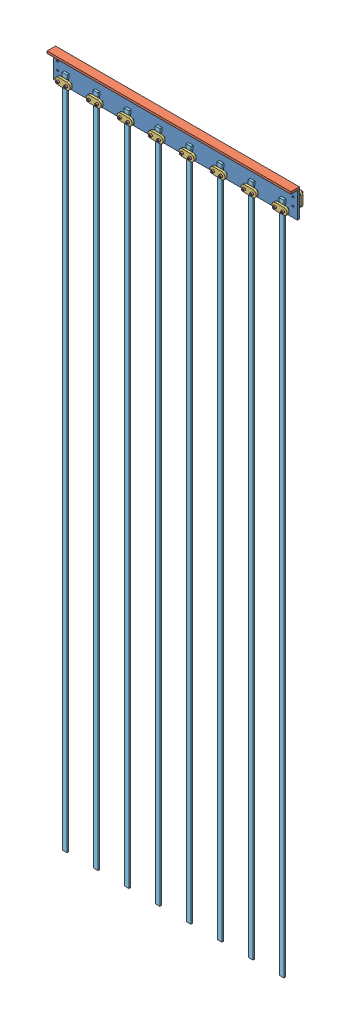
SolidWorks assembly fs-ua-left-mount-assembly-with-led-strips.SLDASM, configuration Default (file format 9000). Lengths in mm.
Overall size (723.9 2044.33 45.12).
42 component instances, 5 part files, 0 mates.
Components (placement in the parent):
- fs-ua-left-mount-assembly-with-screws-1: fs-ua-left-mount-assembly-with-screws.SLDASM [Default] at origin size (723.9 82.55 45.12)
  - fs-ua-left-mount-assembly-1: fs-ua-left-mount-assembly.SLDASM [Default] at origin size (723.9 82.55 38.15)
    - fs-ua-left-mount-vertical-component-1: fs-ua-left-mount-vertical-component.SLDPRT [Default] at origin size (723.9 76.2 6.35)
    - fs-ua-left-mount-horizontal-component-1: fs-ua-left-mount-horizontal-component.SLDPRT [Default] at (361.95 76.2 12.7) size (723.9 6.35 25.4)
    - fs-clamp-1: fs-clamp.SLDPRT [Default] at (27.94 15.24 12.7326) size (44.45 20.32 6.35)
    - fs-clamp-2: fs-clamp.SLDPRT [Default] at (12.7 29.845 -12.7409) x (0 1 0) z (0 0 1) size (44.45 20.32 6.35)
    - fs-clamp-3: fs-clamp.SLDPRT [Default] at (711.2 29.845 -6.3972) x (0 1 0) z (0 0 -1) size (44.45 20.32 6.35)
    - fs-clamp-4: fs-clamp.SLDPRT [Default] at (119.9243 15.24 12.7326) size (44.45 20.32 6.35)
    - fs-clamp-5: fs-clamp.SLDPRT [Default] at (211.9086 15.24 12.7326) size (44.45 20.32 6.35)
    - fs-clamp-6: fs-clamp.SLDPRT [Default] at (303.893 15.24 12.7326) size (44.45 20.32 6.35)
    - fs-clamp-7: fs-clamp.SLDPRT [Default] at (395.8773 15.24 12.7326) size (44.45 20.32 6.35)
    - fs-clamp-8: fs-clamp.SLDPRT [Default] at (487.8616 15.24 12.7326) size (44.45 20.32 6.35)
    - fs-clamp-9: fs-clamp.SLDPRT [Default] at (579.8459 15.24 12.7326) size (44.45 20.32 6.35)
    - fs-clamp-10: fs-clamp.SLDPRT [Default] at (671.8303 15.24 12.7326) size (44.45 20.32 6.35)
  - socket head cap screw_ai-1: socket head cap screw_ai.sldprt [HX-SHCS 0.19-32x0.875x0.875-N] at (27.94 15.24 25.0524) x (0 0 -1) z (-0.570283 0.821448 0) size (27.05 7.94 7.94)
  - socket head cap screw_ai-2: socket head cap screw_ai.sldprt [HX-SHCS 0.19-32x0.875x0.875-N] at (711.2 53.975 -19.4006) x (0 0 1) z (-0.954871 -0.29702 0) size (27.05 7.94 7.94)
  - socket head cap screw_ai-3: socket head cap screw_ai.sldprt [HX-SHCS 0.19-32x0.875x0.875-N] at (711.2 29.845 -19.7235) x (0 0 1) z (-0.178736 -0.983897 0) size (27.05 7.94 7.94)
  - socket head cap screw_ai-4: socket head cap screw_ai.sldprt [HX-SHCS 0.19-32x0.875x0.875-N] at (12.7 53.975 -19.387) x (0 0 1) z (0.231262 0.972891 0) size (27.05 7.94 7.94)
  - socket head cap screw_ai-5: socket head cap screw_ai.sldprt [HX-SHCS 0.19-32x0.875x0.875-N] at (12.7 29.845 -19.6757) x (0 0 1) z (-0.841681 -0.539975 0) size (27.05 7.94 7.94)
  - socket head cap screw_ai-6: socket head cap screw_ai.sldprt [HX-SHCS 0.19-32x0.875x0.875-N] at (52.07 15.24 25.3347) x (0 0 -1) z (0.61191 -0.790927 0) size (27.05 7.94 7.94)
  - socket head cap screw_ai-7: socket head cap screw_ai.sldprt [HX-SHCS 0.19-32x0.875x0.875-N] at (119.9251 15.24 25.0524) x (0 0 -1) z (-0.570283 0.821448 0) size (27.05 7.94 7.94)
  - socket head cap screw_ai-8: socket head cap screw_ai.sldprt [HX-SHCS 0.19-32x0.875x0.875-N] at (211.9102 15.24 25.0524) x (0 0 -1) z (-0.570283 0.821448 0) size (27.05 7.94 7.94)
  - socket head cap screw_ai-9: socket head cap screw_ai.sldprt [HX-SHCS 0.19-32x0.875x0.875-N] at (303.8953 15.24 25.0524) x (0 0 -1) z (-0.570283 0.821448 0) size (27.05 7.94 7.94)
  - socket head cap screw_ai-10: socket head cap screw_ai.sldprt [HX-SHCS 0.19-32x0.875x0.875-N] at (395.8803 15.24 25.0524) x (0 0 -1) z (-0.570283 0.821448 0) size (27.05 7.94 7.94)
  - socket head cap screw_ai-11: socket head cap screw_ai.sldprt [HX-SHCS 0.19-32x0.875x0.875-N] at (487.8654 15.24 25.0524) x (0 0 -1) z (-0.570283 0.821448 0) size (27.05 7.94 7.94)
  - socket head cap screw_ai-12: socket head cap screw_ai.sldprt [HX-SHCS 0.19-32x0.875x0.875-N] at (579.8505 15.24 25.0524) x (0 0 -1) z (-0.570283 0.821448 0) size (27.05 7.94 7.94)
  - socket head cap screw_ai-13: socket head cap screw_ai.sldprt [HX-SHCS 0.19-32x0.875x0.875-N] at (671.8356 15.24 25.0524) x (0 0 -1) z (-0.570283 0.821448 0) size (27.05 7.94 7.94)
  - socket head cap screw_ai-14: socket head cap screw_ai.sldprt [HX-SHCS 0.19-32x0.875x0.875-N] at (144.0551 15.24 25.3347) x (0 0 -1) z (0.61191 -0.790927 0) size (27.05 7.94 7.94)
  - socket head cap screw_ai-15: socket head cap screw_ai.sldprt [HX-SHCS 0.19-32x0.875x0.875-N] at (236.0402 15.24 25.3347) x (0 0 -1) z (0.61191 -0.790927 0) size (27.05 7.94 7.94)
  - socket head cap screw_ai-16: socket head cap screw_ai.sldprt [HX-SHCS 0.19-32x0.875x0.875-N] at (328.0253 15.24 25.3347) x (0 0 -1) z (0.61191 -0.790927 0) size (27.05 7.94 7.94)
  - socket head cap screw_ai-17: socket head cap screw_ai.sldprt [HX-SHCS 0.19-32x0.875x0.875-N] at (420.0103 15.24 25.3347) x (0 0 -1) z (0.61191 -0.790927 0) size (27.05 7.94 7.94)
  - socket head cap screw_ai-18: socket head cap screw_ai.sldprt [HX-SHCS 0.19-32x0.875x0.875-N] at (511.9954 15.24 25.3347) x (0 0 -1) z (0.61191 -0.790927 0) size (27.05 7.94 7.94)
  - socket head cap screw_ai-19: socket head cap screw_ai.sldprt [HX-SHCS 0.19-32x0.875x0.875-N] at (603.9805 15.24 25.3347) x (0 0 -1) z (0.61191 -0.790927 0) size (27.05 7.94 7.94)
  - socket head cap screw_ai-20: socket head cap screw_ai.sldprt [HX-SHCS 0.19-32x0.875x0.875-N] at (695.9656 15.24 25.3347) x (0 0 -1) z (0.61191 -0.790927 0) size (27.05 7.94 7.94)
- fs-led-strip-2: fs-led-strip.SLDPRT [Default] at (39.8281 32.6608 10.0075) size (14.29 2000 6.35)
- fs-led-strip-3: fs-led-strip.SLDPRT [Default] at (131.8132 32.6608 10.0075) size (14.29 2000 6.35)
- fs-led-strip-4: fs-led-strip.SLDPRT [Default] at (223.7983 32.6608 10.0075) size (14.29 2000 6.35)
- fs-led-strip-5: fs-led-strip.SLDPRT [Default] at (315.7834 32.6608 10.0075) size (14.29 2000 6.35)
- fs-led-strip-6: fs-led-strip.SLDPRT [Default] at (407.7685 32.6608 10.0075) size (14.29 2000 6.35)
- fs-led-strip-7: fs-led-strip.SLDPRT [Default] at (499.7536 32.6608 10.0075) size (14.29 2000 6.35)
- fs-led-strip-8: fs-led-strip.SLDPRT [Default] at (591.7386 32.6608 10.0075) size (14.29 2000 6.35)
- fs-led-strip-9: fs-led-strip.SLDPRT [Default] at (683.7237 32.6608 10.0075) size (14.29 2000 6.35)
